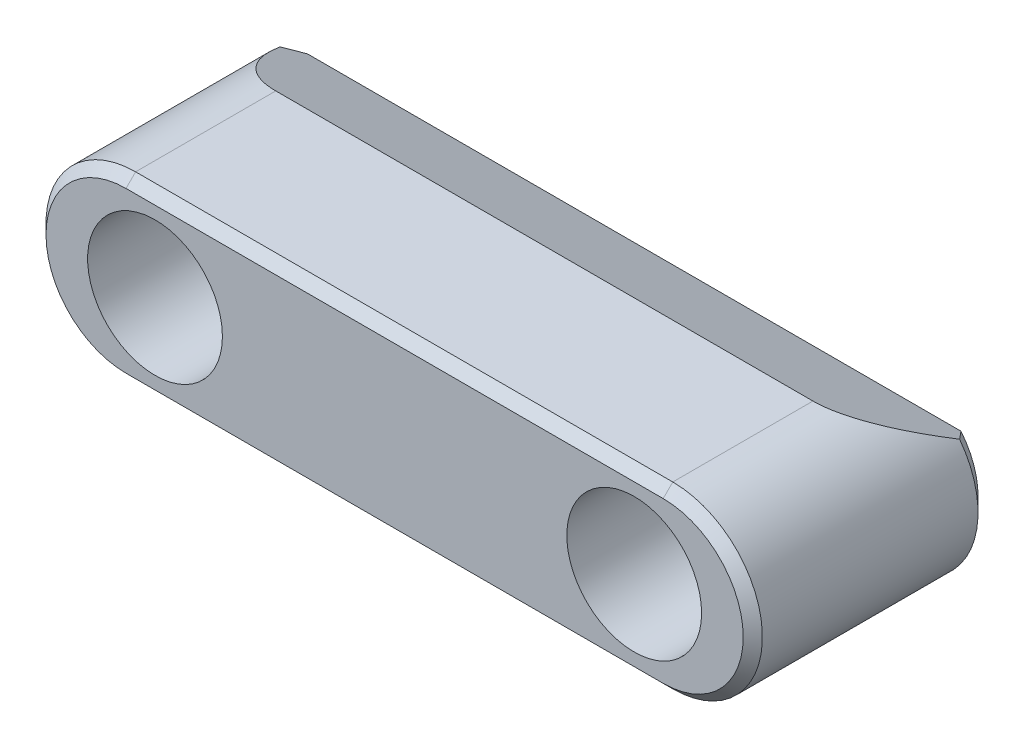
ISO-10303-21;
HEADER;
FILE_DESCRIPTION(('STEP AP214'),'2;1');
FILE_NAME('part.step','',(''),(''),'','','');
FILE_SCHEMA(('AUTOMOTIVE_DESIGN { 1 0 10303 214 1 1 1 1 }'));
ENDSEC;
DATA;
#1=APPLICATION_CONTEXT('core data for automotive mechanical design processes');
#2=APPLICATION_PROTOCOL_DEFINITION('international standard','automotive_design',2000,#1);
#3=PRODUCT_CONTEXT('',#1,'mechanical');
#4=PRODUCT('Part','Part','',(#3));
#5=PRODUCT_RELATED_PRODUCT_CATEGORY('part','',(#4));
#6=PRODUCT_DEFINITION_FORMATION('','',#4);
#7=PRODUCT_DEFINITION_CONTEXT('part definition',#1,'design');
#8=PRODUCT_DEFINITION('design','',#6,#7);
#9=PRODUCT_DEFINITION_SHAPE('','',#8);
#10=(LENGTH_UNIT() NAMED_UNIT(*) SI_UNIT(.MILLI.,.METRE.));
#11=(NAMED_UNIT(*) PLANE_ANGLE_UNIT() SI_UNIT($,.RADIAN.));
#12=(NAMED_UNIT(*) SI_UNIT($,.STERADIAN.) SOLID_ANGLE_UNIT());
#13=UNCERTAINTY_MEASURE_WITH_UNIT(LENGTH_MEASURE(1.E-05),#10,'distance_accuracy_value','');
#14=(GEOMETRIC_REPRESENTATION_CONTEXT(3) GLOBAL_UNCERTAINTY_ASSIGNED_CONTEXT((#13)) GLOBAL_UNIT_ASSIGNED_CONTEXT((#10,
#11,#12)) REPRESENTATION_CONTEXT('',''));
#15=CARTESIAN_POINT('',(0.,0.,0.));
#16=DIRECTION('',(0.,0.,1.));
#17=DIRECTION('',(1.,0.,0.));
#18=AXIS2_PLACEMENT_3D('',#15,#16,#17);
#19=CARTESIAN_POINT('',(-14.2367,0.,-12.7));
#20=DIRECTION('',(0.,0.,1.));
#21=DIRECTION('',(1.,0.,0.));
#22=AXIS2_PLACEMENT_3D('',#19,#20,#21);
#23=CYLINDRICAL_SURFACE('',#22,4.7498);
#24=CARTESIAN_POINT('',(-14.2367,0.,-18.1234789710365));
#25=DIRECTION('',(0.,-0.906307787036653,0.422618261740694));
#26=DIRECTION('',(0.,0.422618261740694,0.906307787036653));
#27=AXIS2_PLACEMENT_3D('',#24,#25,#26);
#28=ELLIPSE('',#27,11.2389842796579,4.7498);
#29=CARTESIAN_POINT('',(-18.0104520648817,2.88433621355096,-11.938));
#30=VERTEX_POINT('',#29);
#31=CARTESIAN_POINT('',(-14.2367,4.7498,-7.9375));
#32=VERTEX_POINT('',#31);
#33=EDGE_CURVE('E104',#30,#32,#28,.F.);
#34=ORIENTED_EDGE('',*,*,#33,.F.);
#35=CARTESIAN_POINT('',(-14.2367,0.,-11.938));
#36=DIRECTION('',(0.,0.,1.));
#37=DIRECTION('',(1.,0.,0.));
#38=AXIS2_PLACEMENT_3D('',#35,#36,#37);
#39=CIRCLE('',#38,4.7498);
#40=CARTESIAN_POINT('',(-14.2367,-4.7498,-11.938));
#41=VERTEX_POINT('',#40);
#42=EDGE_CURVE('E161',#30,#41,#39,.T.);
#43=ORIENTED_EDGE('',*,*,#42,.T.);
#44=DIRECTION('',(0.,0.,1.));
#45=VECTOR('',#44,1.);
#46=CARTESIAN_POINT('',(-14.2367,-4.7498,-12.7));
#47=LINE('',#46,#45);
#48=CARTESIAN_POINT('',(-14.2367,-4.7498,-0.507999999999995));
#49=VERTEX_POINT('',#48);
#50=EDGE_CURVE('E142',#41,#49,#47,.T.);
#51=ORIENTED_EDGE('',*,*,#50,.T.);
#52=CARTESIAN_POINT('',(-14.2367,0.,-0.507999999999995));
#53=DIRECTION('',(0.,0.,1.));
#54=DIRECTION('',(1.,0.,0.));
#55=AXIS2_PLACEMENT_3D('',#52,#53,#54);
#56=CIRCLE('',#55,4.7498);
#57=CARTESIAN_POINT('',(-14.2367,4.7498,-0.507999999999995));
#58=VERTEX_POINT('',#57);
#59=EDGE_CURVE('E129',#49,#58,#56,.F.);
#60=ORIENTED_EDGE('',*,*,#59,.T.);
#61=DIRECTION('',(0.,0.,1.));
#62=VECTOR('',#61,1.);
#63=CARTESIAN_POINT('',(-14.2367,4.7498,-12.7));
#64=LINE('',#63,#62);
#65=EDGE_CURVE('E122',#32,#58,#64,.T.);
#66=ORIENTED_EDGE('',*,*,#65,.F.);
#67=EDGE_LOOP('',(#34,#43,#51,#60,#66));
#68=FACE_BOUND('',#67,.T.);
#69=ADVANCED_FACE('F32',(#68),#23,.T.);
#70=CARTESIAN_POINT('',(-14.2367,4.7498,-12.7));
#71=DIRECTION('',(0.,1.,0.));
#72=DIRECTION('',(0.,0.,1.));
#73=AXIS2_PLACEMENT_3D('',#70,#71,#72);
#74=PLANE('',#73);
#75=ORIENTED_EDGE('',*,*,#65,.T.);
#76=DIRECTION('',(1.,0.,0.));
#77=VECTOR('',#76,1.);
#78=CARTESIAN_POINT('',(-14.2367,4.7498,-0.507999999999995));
#79=LINE('',#78,#77);
#80=CARTESIAN_POINT('',(14.2367,4.7498,-0.507999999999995));
#81=VERTEX_POINT('',#80);
#82=EDGE_CURVE('E159',#58,#81,#79,.T.);
#83=ORIENTED_EDGE('',*,*,#82,.T.);
#84=DIRECTION('',(0.,0.,1.));
#85=VECTOR('',#84,1.);
#86=CARTESIAN_POINT('',(14.2367,4.7498,-12.7));
#87=LINE('',#86,#85);
#88=CARTESIAN_POINT('',(14.2367,4.7498,-7.9375));
#89=VERTEX_POINT('',#88);
#90=EDGE_CURVE('E125',#89,#81,#87,.T.);
#91=ORIENTED_EDGE('',*,*,#90,.F.);
#92=DIRECTION('',(1.,0.,0.));
#93=VECTOR('',#92,1.);
#94=CARTESIAN_POINT('',(-18.9865,4.7498,-7.9375));
#95=LINE('',#94,#93);
#96=EDGE_CURVE('E108',#32,#89,#95,.T.);
#97=ORIENTED_EDGE('',*,*,#96,.F.);
#98=EDGE_LOOP('',(#75,#83,#91,#97));
#99=FACE_BOUND('',#98,.T.);
#100=ADVANCED_FACE('F121',(#99),#74,.T.);
#101=CARTESIAN_POINT('',(14.2367,0.,-12.7));
#102=DIRECTION('',(0.,0.,1.));
#103=DIRECTION('',(1.,0.,0.));
#104=AXIS2_PLACEMENT_3D('',#101,#102,#103);
#105=CYLINDRICAL_SURFACE('',#104,4.7498);
#106=DIRECTION('',(0.,0.,1.));
#107=VECTOR('',#106,1.);
#108=CARTESIAN_POINT('',(14.2367,-4.7498,-12.7));
#109=LINE('',#108,#107);
#110=CARTESIAN_POINT('',(14.2367,-4.7498,-11.938));
#111=VERTEX_POINT('',#110);
#112=CARTESIAN_POINT('',(14.2367,-4.7498,-0.507999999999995));
#113=VERTEX_POINT('',#112);
#114=EDGE_CURVE('E135',#111,#113,#109,.T.);
#115=ORIENTED_EDGE('',*,*,#114,.F.);
#116=CARTESIAN_POINT('',(14.2367,0.,-11.938));
#117=DIRECTION('',(0.,0.,1.));
#118=DIRECTION('',(1.,0.,0.));
#119=AXIS2_PLACEMENT_3D('',#116,#117,#118);
#120=CIRCLE('',#119,4.7498);
#121=CARTESIAN_POINT('',(18.0104520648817,2.88433621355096,-11.938));
#122=VERTEX_POINT('',#121);
#123=EDGE_CURVE('E42',#111,#122,#120,.T.);
#124=ORIENTED_EDGE('',*,*,#123,.T.);
#125=CARTESIAN_POINT('',(14.2367,0.,-18.1234789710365));
#126=DIRECTION('',(0.,-0.906307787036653,0.422618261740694));
#127=DIRECTION('',(0.,0.422618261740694,0.906307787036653));
#128=AXIS2_PLACEMENT_3D('',#125,#126,#127);
#129=ELLIPSE('',#128,11.2389842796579,4.7498);
#130=EDGE_CURVE('E116',#89,#122,#129,.F.);
#131=ORIENTED_EDGE('',*,*,#130,.F.);
#132=ORIENTED_EDGE('',*,*,#90,.T.);
#133=CARTESIAN_POINT('',(14.2367,0.,-0.507999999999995));
#134=DIRECTION('',(0.,0.,1.));
#135=DIRECTION('',(1.,0.,0.));
#136=AXIS2_PLACEMENT_3D('',#133,#134,#135);
#137=CIRCLE('',#136,4.7498);
#138=EDGE_CURVE('E155',#81,#113,#137,.F.);
#139=ORIENTED_EDGE('',*,*,#138,.T.);
#140=EDGE_LOOP('',(#115,#124,#131,#132,#139));
#141=FACE_BOUND('',#140,.T.);
#142=ADVANCED_FACE('F230',(#141),#105,.T.);
#143=CARTESIAN_POINT('',(-14.2367,-4.7498,-12.7));
#144=DIRECTION('',(0.,-1.,0.));
#145=DIRECTION('',(0.,0.,-1.));
#146=AXIS2_PLACEMENT_3D('',#143,#144,#145);
#147=PLANE('',#146);
#148=ORIENTED_EDGE('',*,*,#50,.F.);
#149=DIRECTION('',(1.,0.,0.));
#150=VECTOR('',#149,1.);
#151=CARTESIAN_POINT('',(14.2367,-4.7498,-11.938));
#152=LINE('',#151,#150);
#153=EDGE_CURVE('E11',#41,#111,#152,.T.);
#154=ORIENTED_EDGE('',*,*,#153,.T.);
#155=ORIENTED_EDGE('',*,*,#114,.T.);
#156=DIRECTION('',(-1.,0.,0.));
#157=VECTOR('',#156,1.);
#158=CARTESIAN_POINT('',(-14.2367,-4.7498,-0.507999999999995));
#159=LINE('',#158,#157);
#160=EDGE_CURVE('E152',#113,#49,#159,.T.);
#161=ORIENTED_EDGE('',*,*,#160,.T.);
#162=EDGE_LOOP('',(#148,#154,#155,#161));
#163=FACE_BOUND('',#162,.T.);
#164=ADVANCED_FACE('F223',(#163),#147,.T.);
#165=CARTESIAN_POINT('',(-14.2367,0.,-12.7));
#166=DIRECTION('',(0.,0.,1.));
#167=DIRECTION('',(1.,0.,0.));
#168=AXIS2_PLACEMENT_3D('',#165,#166,#167);
#169=PLANE('',#168);
#170=CARTESIAN_POINT('',(-12.7,0.,-12.7));
#171=DIRECTION('',(0.,0.,1.));
#172=DIRECTION('',(1.,0.,0.));
#173=AXIS2_PLACEMENT_3D('',#170,#171,#172);
#174=CIRCLE('',#173,2.15265);
#175=CARTESIAN_POINT('',(-10.54735,0.,-12.7));
#176=VERTEX_POINT('',#175);
#177=EDGE_CURVE('E281',#176,#176,#174,.T.);
#178=ORIENTED_EDGE('',*,*,#177,.T.);
#179=EDGE_LOOP('',(#178));
#180=FACE_BOUND('',#179,.T.);
#181=CARTESIAN_POINT('',(12.7,0.,-12.7));
#182=DIRECTION('',(0.,0.,1.));
#183=DIRECTION('',(1.,0.,0.));
#184=AXIS2_PLACEMENT_3D('',#181,#182,#183);
#185=CIRCLE('',#184,2.15265);
#186=CARTESIAN_POINT('',(14.85265,0.,-12.7));
#187=VERTEX_POINT('',#186);
#188=EDGE_CURVE('E138',#187,#187,#185,.T.);
#189=ORIENTED_EDGE('',*,*,#188,.T.);
#190=EDGE_LOOP('',(#189));
#191=FACE_BOUND('',#190,.T.);
#192=DIRECTION('',(-1.,0.,0.));
#193=VECTOR('',#192,1.);
#194=CARTESIAN_POINT('',(-14.2367,-3.98779999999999,-12.7));
#195=LINE('',#194,#193);
#196=CARTESIAN_POINT('',(14.2367,-3.98779999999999,-12.7));
#197=VERTEX_POINT('',#196);
#198=CARTESIAN_POINT('',(-14.2367,-3.98779999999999,-12.7));
#199=VERTEX_POINT('',#198);
#200=EDGE_CURVE('E173',#197,#199,#195,.T.);
#201=ORIENTED_EDGE('',*,*,#200,.T.);
#202=CARTESIAN_POINT('',(-14.2367,0.,-12.7));
#203=DIRECTION('',(0.,0.,1.));
#204=DIRECTION('',(1.,0.,0.));
#205=AXIS2_PLACEMENT_3D('',#202,#203,#204);
#206=CIRCLE('',#205,3.98779999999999);
#207=CARTESIAN_POINT('',(-17.3199869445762,2.52900977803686,-12.7));
#208=VERTEX_POINT('',#207);
#209=EDGE_CURVE('E177',#199,#208,#206,.F.);
#210=ORIENTED_EDGE('',*,*,#209,.T.);
#211=DIRECTION('',(1.,0.,0.));
#212=VECTOR('',#211,1.);
#213=CARTESIAN_POINT('',(-14.2367,2.52900977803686,-12.7));
#214=LINE('',#213,#212);
#215=CARTESIAN_POINT('',(17.3199869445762,2.52900977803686,-12.7));
#216=VERTEX_POINT('',#215);
#217=EDGE_CURVE('E130',#208,#216,#214,.T.);
#218=ORIENTED_EDGE('',*,*,#217,.T.);
#219=CARTESIAN_POINT('',(14.2367,0.,-12.7));
#220=DIRECTION('',(0.,0.,1.));
#221=DIRECTION('',(1.,0.,0.));
#222=AXIS2_PLACEMENT_3D('',#219,#220,#221);
#223=CIRCLE('',#222,3.98779999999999);
#224=EDGE_CURVE('E175',#216,#197,#223,.F.);
#225=ORIENTED_EDGE('',*,*,#224,.T.);
#226=EDGE_LOOP('',(#201,#210,#218,#225));
#227=FACE_BOUND('',#226,.T.);
#228=ADVANCED_FACE('F220',(#180,#191,#227),#169,.F.);
#229=CARTESIAN_POINT('',(-14.2367,0.,0.));
#230=DIRECTION('',(0.,0.,1.));
#231=DIRECTION('',(1.,0.,0.));
#232=AXIS2_PLACEMENT_3D('',#229,#230,#231);
#233=PLANE('',#232);
#234=CARTESIAN_POINT('',(-14.2367,0.,0.));
#235=DIRECTION('',(0.,0.,1.));
#236=DIRECTION('',(1.,0.,0.));
#237=AXIS2_PLACEMENT_3D('',#234,#235,#236);
#238=CIRCLE('',#237,4.24180000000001);
#239=CARTESIAN_POINT('',(-14.2367,4.24180000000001,0.));
#240=VERTEX_POINT('',#239);
#241=CARTESIAN_POINT('',(-14.2367,-4.24180000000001,0.));
#242=VERTEX_POINT('',#241);
#243=EDGE_CURVE('E145',#240,#242,#238,.T.);
#244=ORIENTED_EDGE('',*,*,#243,.T.);
#245=DIRECTION('',(1.,0.,0.));
#246=VECTOR('',#245,1.);
#247=CARTESIAN_POINT('',(-14.2367,-4.24180000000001,0.));
#248=LINE('',#247,#246);
#249=CARTESIAN_POINT('',(14.2367,-4.24180000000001,0.));
#250=VERTEX_POINT('',#249);
#251=EDGE_CURVE('E149',#242,#250,#248,.T.);
#252=ORIENTED_EDGE('',*,*,#251,.T.);
#253=CARTESIAN_POINT('',(14.2367,0.,0.));
#254=DIRECTION('',(0.,0.,1.));
#255=DIRECTION('',(1.,0.,0.));
#256=AXIS2_PLACEMENT_3D('',#253,#254,#255);
#257=CIRCLE('',#256,4.24180000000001);
#258=CARTESIAN_POINT('',(14.2367,4.24180000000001,0.));
#259=VERTEX_POINT('',#258);
#260=EDGE_CURVE('E147',#250,#259,#257,.T.);
#261=ORIENTED_EDGE('',*,*,#260,.T.);
#262=DIRECTION('',(-1.,0.,0.));
#263=VECTOR('',#262,1.);
#264=CARTESIAN_POINT('',(-14.2367,4.24180000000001,0.));
#265=LINE('',#264,#263);
#266=EDGE_CURVE('E133',#259,#240,#265,.T.);
#267=ORIENTED_EDGE('',*,*,#266,.T.);
#268=EDGE_LOOP('',(#244,#252,#261,#267));
#269=FACE_BOUND('',#268,.T.);
#270=CARTESIAN_POINT('',(-12.7,0.,0.));
#271=DIRECTION('',(0.,0.,1.));
#272=DIRECTION('',(1.,0.,0.));
#273=AXIS2_PLACEMENT_3D('',#270,#271,#272);
#274=CIRCLE('',#273,3.57251);
#275=CARTESIAN_POINT('',(-9.12749,0.,0.));
#276=VERTEX_POINT('',#275);
#277=EDGE_CURVE('E115',#276,#276,#274,.T.);
#278=ORIENTED_EDGE('',*,*,#277,.F.);
#279=EDGE_LOOP('',(#278));
#280=FACE_BOUND('',#279,.T.);
#281=CARTESIAN_POINT('',(12.7,0.,0.));
#282=DIRECTION('',(0.,0.,1.));
#283=DIRECTION('',(1.,0.,0.));
#284=AXIS2_PLACEMENT_3D('',#281,#282,#283);
#285=CIRCLE('',#284,3.57251);
#286=CARTESIAN_POINT('',(16.27251,0.,0.));
#287=VERTEX_POINT('',#286);
#288=EDGE_CURVE('E284',#287,#287,#285,.T.);
#289=ORIENTED_EDGE('',*,*,#288,.F.);
#290=EDGE_LOOP('',(#289));
#291=FACE_BOUND('',#290,.T.);
#292=ADVANCED_FACE('F218',(#269,#280,#291),#233,.T.);
#293=CARTESIAN_POINT('',(12.7,0.,0.));
#294=DIRECTION('',(0.,0.,1.));
#295=DIRECTION('',(1.,0.,0.));
#296=AXIS2_PLACEMENT_3D('',#293,#294,#295);
#297=CYLINDRICAL_SURFACE('',#296,2.15265);
#298=ORIENTED_EDGE('',*,*,#188,.F.);
#299=EDGE_LOOP('',(#298));
#300=FACE_BOUND('',#299,.T.);
#301=CARTESIAN_POINT('',(12.7,0.,-5.08));
#302=DIRECTION('',(0.,0.,1.));
#303=DIRECTION('',(1.,0.,0.));
#304=AXIS2_PLACEMENT_3D('',#301,#302,#303);
#305=CIRCLE('',#304,2.15265);
#306=CARTESIAN_POINT('',(14.85265,0.,-5.08));
#307=VERTEX_POINT('',#306);
#308=EDGE_CURVE('E289',#307,#307,#305,.T.);
#309=ORIENTED_EDGE('',*,*,#308,.T.);
#310=EDGE_LOOP('',(#309));
#311=FACE_BOUND('',#310,.T.);
#312=ADVANCED_FACE('F214',(#300,#311),#297,.F.);
#313=CARTESIAN_POINT('',(14.85265,0.,-5.08));
#314=DIRECTION('',(0.,0.,-1.));
#315=DIRECTION('',(-1.,0.,0.));
#316=AXIS2_PLACEMENT_3D('',#313,#314,#315);
#317=PLANE('',#316);
#318=ORIENTED_EDGE('',*,*,#308,.F.);
#319=EDGE_LOOP('',(#318));
#320=FACE_BOUND('',#319,.T.);
#321=CARTESIAN_POINT('',(12.7,0.,-5.08));
#322=DIRECTION('',(0.,0.,1.));
#323=DIRECTION('',(1.,0.,0.));
#324=AXIS2_PLACEMENT_3D('',#321,#322,#323);
#325=CIRCLE('',#324,3.57251);
#326=CARTESIAN_POINT('',(16.27251,0.,-5.08));
#327=VERTEX_POINT('',#326);
#328=EDGE_CURVE('E287',#327,#327,#325,.T.);
#329=ORIENTED_EDGE('',*,*,#328,.T.);
#330=EDGE_LOOP('',(#329));
#331=FACE_BOUND('',#330,.T.);
#332=ADVANCED_FACE('F210',(#320,#331),#317,.F.);
#333=CARTESIAN_POINT('',(12.7,0.,0.));
#334=DIRECTION('',(0.,0.,1.));
#335=DIRECTION('',(1.,0.,0.));
#336=AXIS2_PLACEMENT_3D('',#333,#334,#335);
#337=CYLINDRICAL_SURFACE('',#336,3.57251);
#338=ORIENTED_EDGE('',*,*,#328,.F.);
#339=EDGE_LOOP('',(#338));
#340=FACE_BOUND('',#339,.T.);
#341=ORIENTED_EDGE('',*,*,#288,.T.);
#342=EDGE_LOOP('',(#341));
#343=FACE_BOUND('',#342,.T.);
#344=ADVANCED_FACE('F206',(#340,#343),#337,.F.);
#345=CARTESIAN_POINT('',(-12.7,0.,0.));
#346=DIRECTION('',(0.,0.,1.));
#347=DIRECTION('',(1.,0.,0.));
#348=AXIS2_PLACEMENT_3D('',#345,#346,#347);
#349=CYLINDRICAL_SURFACE('',#348,2.15265);
#350=ORIENTED_EDGE('',*,*,#177,.F.);
#351=EDGE_LOOP('',(#350));
#352=FACE_BOUND('',#351,.T.);
#353=CARTESIAN_POINT('',(-12.7,0.,-5.08));
#354=DIRECTION('',(0.,0.,1.));
#355=DIRECTION('',(1.,0.,0.));
#356=AXIS2_PLACEMENT_3D('',#353,#354,#355);
#357=CIRCLE('',#356,2.15265);
#358=CARTESIAN_POINT('',(-10.54735,0.,-5.08));
#359=VERTEX_POINT('',#358);
#360=EDGE_CURVE('E278',#359,#359,#357,.T.);
#361=ORIENTED_EDGE('',*,*,#360,.T.);
#362=EDGE_LOOP('',(#361));
#363=FACE_BOUND('',#362,.T.);
#364=ADVANCED_FACE('F202',(#352,#363),#349,.F.);
#365=CARTESIAN_POINT('',(-10.54735,0.,-5.08));
#366=DIRECTION('',(0.,0.,-1.));
#367=DIRECTION('',(-1.,0.,0.));
#368=AXIS2_PLACEMENT_3D('',#365,#366,#367);
#369=PLANE('',#368);
#370=ORIENTED_EDGE('',*,*,#360,.F.);
#371=EDGE_LOOP('',(#370));
#372=FACE_BOUND('',#371,.T.);
#373=CARTESIAN_POINT('',(-12.7,0.,-5.08));
#374=DIRECTION('',(0.,0.,1.));
#375=DIRECTION('',(1.,0.,0.));
#376=AXIS2_PLACEMENT_3D('',#373,#374,#375);
#377=CIRCLE('',#376,3.57251);
#378=CARTESIAN_POINT('',(-9.12749,0.,-5.08));
#379=VERTEX_POINT('',#378);
#380=EDGE_CURVE('E275',#379,#379,#377,.T.);
#381=ORIENTED_EDGE('',*,*,#380,.T.);
#382=EDGE_LOOP('',(#381));
#383=FACE_BOUND('',#382,.T.);
#384=ADVANCED_FACE('F198',(#372,#383),#369,.F.);
#385=CARTESIAN_POINT('',(-12.7,0.,0.));
#386=DIRECTION('',(0.,0.,1.));
#387=DIRECTION('',(1.,0.,0.));
#388=AXIS2_PLACEMENT_3D('',#385,#386,#387);
#389=CYLINDRICAL_SURFACE('',#388,3.57251);
#390=ORIENTED_EDGE('',*,*,#380,.F.);
#391=EDGE_LOOP('',(#390));
#392=FACE_BOUND('',#391,.T.);
#393=ORIENTED_EDGE('',*,*,#277,.T.);
#394=EDGE_LOOP('',(#393));
#395=FACE_BOUND('',#394,.T.);
#396=ADVANCED_FACE('F194',(#392,#395),#389,.F.);
#397=CARTESIAN_POINT('',(-18.9865,4.7498,-7.9375));
#398=DIRECTION('',(0.,-0.906307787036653,0.422618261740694));
#399=DIRECTION('',(0.,-0.422618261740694,-0.906307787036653));
#400=AXIS2_PLACEMENT_3D('',#397,#398,#399);
#401=PLANE('',#400);
#402=ORIENTED_EDGE('',*,*,#217,.F.);
#403=CARTESIAN_POINT('',(-17.3199869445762,2.52900977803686,-12.7));
#404=CARTESIAN_POINT('',(-17.435388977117,2.58811823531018,-12.5732415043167));
#405=CARTESIAN_POINT('',(-17.5506287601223,2.64728300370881,-12.4463622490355));
#406=CARTESIAN_POINT('',(-17.7807838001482,2.76572514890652,-12.192362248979));
#407=CARTESIAN_POINT('',(-17.8956990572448,2.82500252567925,-12.0652415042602));
#408=CARTESIAN_POINT('',(-18.0104520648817,2.88433621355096,-11.938));
#409=B_SPLINE_CURVE_WITH_KNOTS('',3,(#403,#404,#405,#406,#407,#408),.UNSPECIFIED.,.F.,.F.,(4,2,
4),(0.,0.543977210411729,1.08795429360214),.UNSPECIFIED.);
#410=EDGE_CURVE('E110',#208,#30,#409,.T.);
#411=ORIENTED_EDGE('',*,*,#410,.T.);
#412=ORIENTED_EDGE('',*,*,#33,.T.);
#413=ORIENTED_EDGE('',*,*,#96,.T.);
#414=ORIENTED_EDGE('',*,*,#130,.T.);
#415=CARTESIAN_POINT('',(18.0104520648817,2.88433621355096,-11.938));
#416=CARTESIAN_POINT('',(17.8956990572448,2.82500252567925,-12.0652415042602));
#417=CARTESIAN_POINT('',(17.7807838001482,2.76572514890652,-12.192362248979));
#418=CARTESIAN_POINT('',(17.5506287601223,2.64728300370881,-12.4463622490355));
#419=CARTESIAN_POINT('',(17.435388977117,2.58811823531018,-12.5732415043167));
#420=CARTESIAN_POINT('',(17.3199869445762,2.52900977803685,-12.7));
#421=B_SPLINE_CURVE_WITH_KNOTS('',3,(#415,#416,#417,#418,#419,#420),.UNSPECIFIED.,.F.,.F.,(4,2,
4),(0.,0.54397708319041,1.08795429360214),.UNSPECIFIED.);
#422=EDGE_CURVE('E179',#122,#216,#421,.T.);
#423=ORIENTED_EDGE('',*,*,#422,.T.);
#424=EDGE_LOOP('',(#402,#411,#412,#413,#414,#423));
#425=FACE_BOUND('',#424,.T.);
#426=ADVANCED_FACE('F107',(#425),#401,.F.);
#427=CARTESIAN_POINT('',(-14.2367,4.24180000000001,0.));
#428=DIRECTION('',(0.,-0.707106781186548,-0.707106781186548));
#429=DIRECTION('',(-1.,0.,0.));
#430=AXIS2_PLACEMENT_3D('',#427,#428,#429);
#431=PLANE('',#430);
#432=DIRECTION('',(0.,-0.707106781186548,0.707106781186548));
#433=VECTOR('',#432,1.);
#434=CARTESIAN_POINT('',(14.2367,4.7498,-0.507999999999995));
#435=LINE('',#434,#433);
#436=EDGE_CURVE('E167',#81,#259,#435,.T.);
#437=ORIENTED_EDGE('',*,*,#436,.F.);
#438=ORIENTED_EDGE('',*,*,#82,.F.);
#439=DIRECTION('',(0.,0.707106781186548,-0.707106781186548));
#440=VECTOR('',#439,1.);
#441=CARTESIAN_POINT('',(-14.2367,4.24180000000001,0.));
#442=LINE('',#441,#440);
#443=EDGE_CURVE('E126',#240,#58,#442,.T.);
#444=ORIENTED_EDGE('',*,*,#443,.F.);
#445=ORIENTED_EDGE('',*,*,#266,.F.);
#446=EDGE_LOOP('',(#437,#438,#444,#445));
#447=FACE_BOUND('',#446,.T.);
#448=ADVANCED_FACE('F193',(#447),#431,.F.);
#449=CARTESIAN_POINT('',(-14.2367,0.,0.));
#450=DIRECTION('',(0.,0.,-1.));
#451=DIRECTION('',(-1.,0.,0.));
#452=AXIS2_PLACEMENT_3D('',#449,#450,#451);
#453=CONICAL_SURFACE('',#452,4.24180000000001,0.785398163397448);
#454=ORIENTED_EDGE('',*,*,#443,.T.);
#455=ORIENTED_EDGE('',*,*,#59,.F.);
#456=DIRECTION('',(0.,-0.707106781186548,-0.707106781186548));
#457=VECTOR('',#456,1.);
#458=CARTESIAN_POINT('',(-14.2367,-4.24180000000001,0.));
#459=LINE('',#458,#457);
#460=EDGE_CURVE('E164',#242,#49,#459,.T.);
#461=ORIENTED_EDGE('',*,*,#460,.F.);
#462=ORIENTED_EDGE('',*,*,#243,.F.);
#463=EDGE_LOOP('',(#454,#455,#461,#462));
#464=FACE_BOUND('',#463,.T.);
#465=ADVANCED_FACE('F244',(#464),#453,.T.);
#466=CARTESIAN_POINT('',(14.2367,0.,0.));
#467=DIRECTION('',(0.,0.,-1.));
#468=DIRECTION('',(-1.,0.,0.));
#469=AXIS2_PLACEMENT_3D('',#466,#467,#468);
#470=CONICAL_SURFACE('',#469,4.24180000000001,0.785398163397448);
#471=ORIENTED_EDGE('',*,*,#436,.T.);
#472=ORIENTED_EDGE('',*,*,#260,.F.);
#473=DIRECTION('',(0.,0.707106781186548,0.707106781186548));
#474=VECTOR('',#473,1.);
#475=CARTESIAN_POINT('',(14.2367,-4.7498,-0.507999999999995));
#476=LINE('',#475,#474);
#477=EDGE_CURVE('E162',#113,#250,#476,.T.);
#478=ORIENTED_EDGE('',*,*,#477,.F.);
#479=ORIENTED_EDGE('',*,*,#138,.F.);
#480=EDGE_LOOP('',(#471,#472,#478,#479));
#481=FACE_BOUND('',#480,.T.);
#482=ADVANCED_FACE('F240',(#481),#470,.T.);
#483=CARTESIAN_POINT('',(-14.2367,-4.24180000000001,0.));
#484=DIRECTION('',(0.,0.707106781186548,-0.707106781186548));
#485=DIRECTION('',(1.,0.,0.));
#486=AXIS2_PLACEMENT_3D('',#483,#484,#485);
#487=PLANE('',#486);
#488=ORIENTED_EDGE('',*,*,#460,.T.);
#489=ORIENTED_EDGE('',*,*,#160,.F.);
#490=ORIENTED_EDGE('',*,*,#477,.T.);
#491=ORIENTED_EDGE('',*,*,#251,.F.);
#492=EDGE_LOOP('',(#488,#489,#490,#491));
#493=FACE_BOUND('',#492,.T.);
#494=ADVANCED_FACE('F237',(#493),#487,.F.);
#495=CARTESIAN_POINT('',(14.2367,0.,-11.938));
#496=DIRECTION('',(0.,0.,1.));
#497=DIRECTION('',(1.,0.,0.));
#498=AXIS2_PLACEMENT_3D('',#495,#496,#497);
#499=CONICAL_SURFACE('',#498,4.7498,0.785398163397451);
#500=ORIENTED_EDGE('',*,*,#422,.F.);
#501=ORIENTED_EDGE('',*,*,#123,.F.);
#502=DIRECTION('',(0.,-0.707106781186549,0.707106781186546));
#503=VECTOR('',#502,1.);
#504=CARTESIAN_POINT('',(14.2367,-3.98779999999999,-12.7));
#505=LINE('',#504,#503);
#506=EDGE_CURVE('E37',#197,#111,#505,.T.);
#507=ORIENTED_EDGE('',*,*,#506,.F.);
#508=ORIENTED_EDGE('',*,*,#224,.F.);
#509=EDGE_LOOP('',(#500,#501,#507,#508));
#510=FACE_BOUND('',#509,.T.);
#511=ADVANCED_FACE('F34',(#510),#499,.T.);
#512=CARTESIAN_POINT('',(-14.2367,-4.7498,-11.938));
#513=DIRECTION('',(0.,-0.707106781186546,-0.707106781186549));
#514=DIRECTION('',(-1.,0.,0.));
#515=AXIS2_PLACEMENT_3D('',#512,#513,#514);
#516=PLANE('',#515);
#517=ORIENTED_EDGE('',*,*,#506,.T.);
#518=ORIENTED_EDGE('',*,*,#153,.F.);
#519=DIRECTION('',(0.,-0.707106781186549,0.707106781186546));
#520=VECTOR('',#519,1.);
#521=CARTESIAN_POINT('',(-14.2367,-3.98779999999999,-12.7));
#522=LINE('',#521,#520);
#523=EDGE_CURVE('E267',#199,#41,#522,.T.);
#524=ORIENTED_EDGE('',*,*,#523,.F.);
#525=ORIENTED_EDGE('',*,*,#200,.F.);
#526=EDGE_LOOP('',(#517,#518,#524,#525));
#527=FACE_BOUND('',#526,.T.);
#528=ADVANCED_FACE('F254',(#527),#516,.T.);
#529=CARTESIAN_POINT('',(-14.2367,0.,-11.938));
#530=DIRECTION('',(0.,0.,1.));
#531=DIRECTION('',(1.,0.,0.));
#532=AXIS2_PLACEMENT_3D('',#529,#530,#531);
#533=CONICAL_SURFACE('',#532,4.7498,0.785398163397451);
#534=ORIENTED_EDGE('',*,*,#410,.F.);
#535=ORIENTED_EDGE('',*,*,#209,.F.);
#536=ORIENTED_EDGE('',*,*,#523,.T.);
#537=ORIENTED_EDGE('',*,*,#42,.F.);
#538=EDGE_LOOP('',(#534,#535,#536,#537));
#539=FACE_BOUND('',#538,.T.);
#540=ADVANCED_FACE('F251',(#539),#533,.T.);
#541=CLOSED_SHELL('',(#69,#100,#142,#164,#228,#292,#312,#332,#344,#364,#384,#396,#426,#448,#465,
#482,#494,#511,#528,#540));
#542=MANIFOLD_SOLID_BREP('B2',#541);
#543=ADVANCED_BREP_SHAPE_REPRESENTATION('',(#18,#542),#14);
#544=SHAPE_DEFINITION_REPRESENTATION(#9,#543);
ENDSEC;
END-ISO-10303-21;
